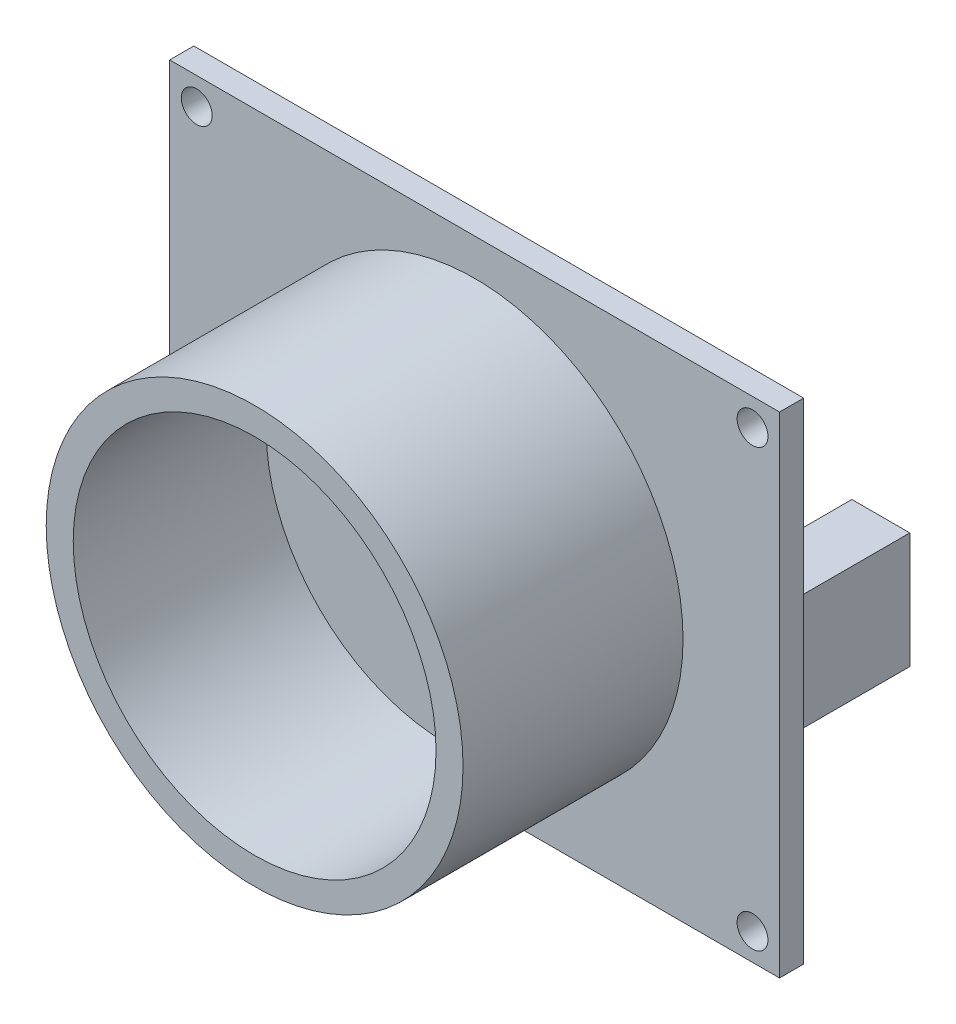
ISO-10303-21;
HEADER;
FILE_DESCRIPTION(('STEP AP214'),'2;1');
FILE_NAME('part.step','',(''),(''),'','','');
FILE_SCHEMA(('AUTOMOTIVE_DESIGN { 1 0 10303 214 1 1 1 1 }'));
ENDSEC;
DATA;
#1=APPLICATION_CONTEXT('core data for automotive mechanical design processes');
#2=APPLICATION_PROTOCOL_DEFINITION('international standard','automotive_design',2000,#1);
#3=PRODUCT_CONTEXT('',#1,'mechanical');
#4=PRODUCT('Part','Part','',(#3));
#5=PRODUCT_RELATED_PRODUCT_CATEGORY('part','',(#4));
#6=PRODUCT_DEFINITION_FORMATION('','',#4);
#7=PRODUCT_DEFINITION_CONTEXT('part definition',#1,'design');
#8=PRODUCT_DEFINITION('design','',#6,#7);
#9=PRODUCT_DEFINITION_SHAPE('','',#8);
#10=(LENGTH_UNIT() NAMED_UNIT(*) SI_UNIT(.MILLI.,.METRE.));
#11=(NAMED_UNIT(*) PLANE_ANGLE_UNIT() SI_UNIT($,.RADIAN.));
#12=(NAMED_UNIT(*) SI_UNIT($,.STERADIAN.) SOLID_ANGLE_UNIT());
#13=UNCERTAINTY_MEASURE_WITH_UNIT(LENGTH_MEASURE(1.E-05),#10,'distance_accuracy_value','');
#14=(GEOMETRIC_REPRESENTATION_CONTEXT(3) GLOBAL_UNCERTAINTY_ASSIGNED_CONTEXT((#13)) GLOBAL_UNIT_ASSIGNED_CONTEXT((#10,
#11,#12)) REPRESENTATION_CONTEXT('',''));
#15=CARTESIAN_POINT('',(0.,0.,0.));
#16=DIRECTION('',(0.,0.,1.));
#17=DIRECTION('',(1.,0.,0.));
#18=AXIS2_PLACEMENT_3D('',#15,#16,#17);
#19=CARTESIAN_POINT('',(0.,0.,0.));
#20=DIRECTION('',(0.,0.,-1.));
#21=DIRECTION('',(-1.,0.,0.));
#22=AXIS2_PLACEMENT_3D('',#19,#20,#21);
#23=PLANE('',#22);
#24=DIRECTION('',(0.,1.,0.));
#25=VECTOR('',#24,1.);
#26=CARTESIAN_POINT('',(20.066,-16.129,0.));
#27=LINE('',#26,#25);
#28=CARTESIAN_POINT('',(20.066,-16.129,0.));
#29=VERTEX_POINT('',#28);
#30=CARTESIAN_POINT('',(20.066,16.129,0.));
#31=VERTEX_POINT('',#30);
#32=EDGE_CURVE('E169',#29,#31,#27,.T.);
#33=ORIENTED_EDGE('',*,*,#32,.F.);
#34=DIRECTION('',(1.,0.,0.));
#35=VECTOR('',#34,1.);
#36=CARTESIAN_POINT('',(-20.066,-16.129,0.));
#37=LINE('',#36,#35);
#38=CARTESIAN_POINT('',(-20.066,-16.129,0.));
#39=VERTEX_POINT('',#38);
#40=EDGE_CURVE('E79',#39,#29,#37,.T.);
#41=ORIENTED_EDGE('',*,*,#40,.F.);
#42=DIRECTION('',(0.,-1.,0.));
#43=VECTOR('',#42,1.);
#44=CARTESIAN_POINT('',(-20.066,-16.129,0.));
#45=LINE('',#44,#43);
#46=CARTESIAN_POINT('',(-20.066,16.129,0.));
#47=VERTEX_POINT('',#46);
#48=EDGE_CURVE('E183',#47,#39,#45,.T.);
#49=ORIENTED_EDGE('',*,*,#48,.F.);
#50=DIRECTION('',(-1.,0.,0.));
#51=VECTOR('',#50,1.);
#52=CARTESIAN_POINT('',(-20.066,16.129,0.));
#53=LINE('',#52,#51);
#54=EDGE_CURVE('E181',#31,#47,#53,.T.);
#55=ORIENTED_EDGE('',*,*,#54,.F.);
#56=EDGE_LOOP('',(#33,#41,#49,#55));
#57=FACE_BOUND('',#56,.T.);
#58=CARTESIAN_POINT('',(18.288,14.351,0.));
#59=DIRECTION('',(0.,0.,1.));
#60=DIRECTION('',(1.,0.,0.));
#61=AXIS2_PLACEMENT_3D('',#58,#59,#60);
#62=CIRCLE('',#61,1.016);
#63=CARTESIAN_POINT('',(19.304,14.351,0.));
#64=VERTEX_POINT('',#63);
#65=EDGE_CURVE('E166',#64,#64,#62,.T.);
#66=ORIENTED_EDGE('',*,*,#65,.T.);
#67=EDGE_LOOP('',(#66));
#68=FACE_BOUND('',#67,.T.);
#69=CARTESIAN_POINT('',(18.288,-14.351,0.));
#70=DIRECTION('',(0.,0.,1.));
#71=DIRECTION('',(-1.,0.,0.));
#72=AXIS2_PLACEMENT_3D('',#69,#70,#71);
#73=CIRCLE('',#72,1.016);
#74=CARTESIAN_POINT('',(17.272,-14.351,0.));
#75=VERTEX_POINT('',#74);
#76=EDGE_CURVE('E160',#75,#75,#73,.T.);
#77=ORIENTED_EDGE('',*,*,#76,.T.);
#78=EDGE_LOOP('',(#77));
#79=FACE_BOUND('',#78,.T.);
#80=CARTESIAN_POINT('',(-18.288,-14.351,0.));
#81=DIRECTION('',(0.,0.,1.));
#82=DIRECTION('',(1.,0.,0.));
#83=AXIS2_PLACEMENT_3D('',#80,#81,#82);
#84=CIRCLE('',#83,1.016);
#85=CARTESIAN_POINT('',(-17.272,-14.351,0.));
#86=VERTEX_POINT('',#85);
#87=EDGE_CURVE('E154',#86,#86,#84,.T.);
#88=ORIENTED_EDGE('',*,*,#87,.T.);
#89=EDGE_LOOP('',(#88));
#90=FACE_BOUND('',#89,.T.);
#91=CARTESIAN_POINT('',(-18.288,14.351,0.));
#92=DIRECTION('',(0.,0.,1.));
#93=DIRECTION('',(-1.,0.,0.));
#94=AXIS2_PLACEMENT_3D('',#91,#92,#93);
#95=CIRCLE('',#94,1.016);
#96=CARTESIAN_POINT('',(-19.304,14.351,0.));
#97=VERTEX_POINT('',#96);
#98=EDGE_CURVE('E148',#97,#97,#95,.T.);
#99=ORIENTED_EDGE('',*,*,#98,.T.);
#100=EDGE_LOOP('',(#99));
#101=FACE_BOUND('',#100,.T.);
#102=DIRECTION('',(1.,0.,0.));
#103=VECTOR('',#102,1.);
#104=CARTESIAN_POINT('',(18.923,3.81,0.));
#105=LINE('',#104,#103);
#106=CARTESIAN_POINT('',(15.113,3.81,0.));
#107=VERTEX_POINT('',#106);
#108=CARTESIAN_POINT('',(18.923,3.81,0.));
#109=VERTEX_POINT('',#108);
#110=EDGE_CURVE('E347',#107,#109,#105,.T.);
#111=ORIENTED_EDGE('',*,*,#110,.F.);
#112=DIRECTION('',(0.,1.,0.));
#113=VECTOR('',#112,1.);
#114=CARTESIAN_POINT('',(15.113,-3.81,0.));
#115=LINE('',#114,#113);
#116=CARTESIAN_POINT('',(15.113,-3.81,0.));
#117=VERTEX_POINT('',#116);
#118=EDGE_CURVE('E132',#117,#107,#115,.T.);
#119=ORIENTED_EDGE('',*,*,#118,.F.);
#120=DIRECTION('',(-1.,0.,0.));
#121=VECTOR('',#120,1.);
#122=CARTESIAN_POINT('',(18.923,-3.81,0.));
#123=LINE('',#122,#121);
#124=CARTESIAN_POINT('',(18.923,-3.81,0.));
#125=VERTEX_POINT('',#124);
#126=EDGE_CURVE('E128',#125,#117,#123,.T.);
#127=ORIENTED_EDGE('',*,*,#126,.F.);
#128=DIRECTION('',(0.,-1.,0.));
#129=VECTOR('',#128,1.);
#130=CARTESIAN_POINT('',(18.923,-3.81,0.));
#131=LINE('',#130,#129);
#132=EDGE_CURVE('E344',#109,#125,#131,.T.);
#133=ORIENTED_EDGE('',*,*,#132,.F.);
#134=EDGE_LOOP('',(#111,#119,#127,#133));
#135=FACE_BOUND('',#134,.T.);
#136=ADVANCED_FACE('F34',(#57,#68,#79,#90,#101,#135),#23,.T.);
#137=CARTESIAN_POINT('',(0.,0.,1.5875));
#138=DIRECTION('',(0.,0.,-1.));
#139=DIRECTION('',(-1.,0.,0.));
#140=AXIS2_PLACEMENT_3D('',#137,#138,#139);
#141=PLANE('',#140);
#142=DIRECTION('',(0.,1.,0.));
#143=VECTOR('',#142,1.);
#144=CARTESIAN_POINT('',(20.066,-16.129,1.5875));
#145=LINE('',#144,#143);
#146=CARTESIAN_POINT('',(20.066,-16.129,1.5875));
#147=VERTEX_POINT('',#146);
#148=CARTESIAN_POINT('',(20.066,16.129,1.5875));
#149=VERTEX_POINT('',#148);
#150=EDGE_CURVE('E172',#147,#149,#145,.T.);
#151=ORIENTED_EDGE('',*,*,#150,.T.);
#152=DIRECTION('',(-1.,0.,0.));
#153=VECTOR('',#152,1.);
#154=CARTESIAN_POINT('',(-20.066,16.129,1.5875));
#155=LINE('',#154,#153);
#156=CARTESIAN_POINT('',(-20.066,16.129,1.5875));
#157=VERTEX_POINT('',#156);
#158=EDGE_CURVE('E87',#149,#157,#155,.T.);
#159=ORIENTED_EDGE('',*,*,#158,.T.);
#160=DIRECTION('',(0.,-1.,0.));
#161=VECTOR('',#160,1.);
#162=CARTESIAN_POINT('',(-20.066,-16.129,1.5875));
#163=LINE('',#162,#161);
#164=CARTESIAN_POINT('',(-20.066,-16.129,1.5875));
#165=VERTEX_POINT('',#164);
#166=EDGE_CURVE('E175',#157,#165,#163,.T.);
#167=ORIENTED_EDGE('',*,*,#166,.T.);
#168=DIRECTION('',(1.,0.,0.));
#169=VECTOR('',#168,1.);
#170=CARTESIAN_POINT('',(-20.066,-16.129,1.5875));
#171=LINE('',#170,#169);
#172=EDGE_CURVE('E58',#165,#147,#171,.T.);
#173=ORIENTED_EDGE('',*,*,#172,.T.);
#174=EDGE_LOOP('',(#151,#159,#167,#173));
#175=FACE_BOUND('',#174,.T.);
#176=CARTESIAN_POINT('',(18.288,14.351,1.5875));
#177=DIRECTION('',(0.,0.,1.));
#178=DIRECTION('',(1.,0.,0.));
#179=AXIS2_PLACEMENT_3D('',#176,#177,#178);
#180=CIRCLE('',#179,1.016);
#181=CARTESIAN_POINT('',(19.304,14.351,1.5875));
#182=VERTEX_POINT('',#181);
#183=EDGE_CURVE('E163',#182,#182,#180,.T.);
#184=ORIENTED_EDGE('',*,*,#183,.F.);
#185=EDGE_LOOP('',(#184));
#186=FACE_BOUND('',#185,.T.);
#187=CARTESIAN_POINT('',(18.288,-14.351,1.5875));
#188=DIRECTION('',(0.,0.,1.));
#189=DIRECTION('',(-1.,0.,0.));
#190=AXIS2_PLACEMENT_3D('',#187,#188,#189);
#191=CIRCLE('',#190,1.016);
#192=CARTESIAN_POINT('',(17.272,-14.351,1.5875));
#193=VERTEX_POINT('',#192);
#194=EDGE_CURVE('E157',#193,#193,#191,.T.);
#195=ORIENTED_EDGE('',*,*,#194,.F.);
#196=EDGE_LOOP('',(#195));
#197=FACE_BOUND('',#196,.T.);
#198=CARTESIAN_POINT('',(-18.288,-14.351,1.5875));
#199=DIRECTION('',(0.,0.,1.));
#200=DIRECTION('',(1.,0.,0.));
#201=AXIS2_PLACEMENT_3D('',#198,#199,#200);
#202=CIRCLE('',#201,1.016);
#203=CARTESIAN_POINT('',(-17.272,-14.351,1.5875));
#204=VERTEX_POINT('',#203);
#205=EDGE_CURVE('E151',#204,#204,#202,.T.);
#206=ORIENTED_EDGE('',*,*,#205,.F.);
#207=EDGE_LOOP('',(#206));
#208=FACE_BOUND('',#207,.T.);
#209=CARTESIAN_POINT('',(-18.288,14.351,1.5875));
#210=DIRECTION('',(0.,0.,1.));
#211=DIRECTION('',(-1.,0.,0.));
#212=AXIS2_PLACEMENT_3D('',#209,#210,#211);
#213=CIRCLE('',#212,1.016);
#214=CARTESIAN_POINT('',(-19.304,14.351,1.5875));
#215=VERTEX_POINT('',#214);
#216=EDGE_CURVE('E147',#215,#215,#213,.T.);
#217=ORIENTED_EDGE('',*,*,#216,.F.);
#218=EDGE_LOOP('',(#217));
#219=FACE_BOUND('',#218,.T.);
#220=CARTESIAN_POINT('',(0.,0.,1.5875));
#221=DIRECTION('',(0.,0.,-1.));
#222=DIRECTION('',(-1.,0.,0.));
#223=AXIS2_PLACEMENT_3D('',#220,#221,#222);
#224=CIRCLE('',#223,13.716);
#225=CARTESIAN_POINT('',(-13.716,0.,1.5875));
#226=VERTEX_POINT('',#225);
#227=EDGE_CURVE('E11',#226,#226,#224,.F.);
#228=ORIENTED_EDGE('',*,*,#227,.F.);
#229=EDGE_LOOP('',(#228));
#230=FACE_BOUND('',#229,.T.);
#231=ADVANCED_FACE('F204',(#175,#186,#197,#208,#219,#230),#141,.F.);
#232=CARTESIAN_POINT('',(20.066,-16.129,1.5875));
#233=DIRECTION('',(-1.,0.,0.));
#234=DIRECTION('',(0.,0.,1.));
#235=AXIS2_PLACEMENT_3D('',#232,#233,#234);
#236=PLANE('',#235);
#237=ORIENTED_EDGE('',*,*,#32,.T.);
#238=DIRECTION('',(0.,0.,-1.));
#239=VECTOR('',#238,1.);
#240=CARTESIAN_POINT('',(20.066,16.129,1.5875));
#241=LINE('',#240,#239);
#242=EDGE_CURVE('E42',#149,#31,#241,.T.);
#243=ORIENTED_EDGE('',*,*,#242,.F.);
#244=ORIENTED_EDGE('',*,*,#150,.F.);
#245=DIRECTION('',(0.,0.,-1.));
#246=VECTOR('',#245,1.);
#247=CARTESIAN_POINT('',(20.066,-16.129,1.5875));
#248=LINE('',#247,#246);
#249=EDGE_CURVE('E178',#147,#29,#248,.T.);
#250=ORIENTED_EDGE('',*,*,#249,.T.);
#251=EDGE_LOOP('',(#237,#243,#244,#250));
#252=FACE_BOUND('',#251,.T.);
#253=ADVANCED_FACE('F36',(#252),#236,.F.);
#254=CARTESIAN_POINT('',(-20.066,16.129,1.5875));
#255=DIRECTION('',(0.,-1.,0.));
#256=DIRECTION('',(0.,0.,-1.));
#257=AXIS2_PLACEMENT_3D('',#254,#255,#256);
#258=PLANE('',#257);
#259=ORIENTED_EDGE('',*,*,#54,.T.);
#260=DIRECTION('',(0.,0.,-1.));
#261=VECTOR('',#260,1.);
#262=CARTESIAN_POINT('',(-20.066,16.129,1.5875));
#263=LINE('',#262,#261);
#264=EDGE_CURVE('E189',#157,#47,#263,.T.);
#265=ORIENTED_EDGE('',*,*,#264,.F.);
#266=ORIENTED_EDGE('',*,*,#158,.F.);
#267=ORIENTED_EDGE('',*,*,#242,.T.);
#268=EDGE_LOOP('',(#259,#265,#266,#267));
#269=FACE_BOUND('',#268,.T.);
#270=ADVANCED_FACE('F192',(#269),#258,.F.);
#271=CARTESIAN_POINT('',(-20.066,-16.129,1.5875));
#272=DIRECTION('',(1.,0.,0.));
#273=DIRECTION('',(0.,0.,-1.));
#274=AXIS2_PLACEMENT_3D('',#271,#272,#273);
#275=PLANE('',#274);
#276=ORIENTED_EDGE('',*,*,#48,.T.);
#277=DIRECTION('',(0.,0.,-1.));
#278=VECTOR('',#277,1.);
#279=CARTESIAN_POINT('',(-20.066,-16.129,1.5875));
#280=LINE('',#279,#278);
#281=EDGE_CURVE('E187',#165,#39,#280,.T.);
#282=ORIENTED_EDGE('',*,*,#281,.F.);
#283=ORIENTED_EDGE('',*,*,#166,.F.);
#284=ORIENTED_EDGE('',*,*,#264,.T.);
#285=EDGE_LOOP('',(#276,#282,#283,#284));
#286=FACE_BOUND('',#285,.T.);
#287=ADVANCED_FACE('F201',(#286),#275,.F.);
#288=CARTESIAN_POINT('',(-20.066,-16.129,1.5875));
#289=DIRECTION('',(0.,1.,0.));
#290=DIRECTION('',(0.,0.,1.));
#291=AXIS2_PLACEMENT_3D('',#288,#289,#290);
#292=PLANE('',#291);
#293=ORIENTED_EDGE('',*,*,#40,.T.);
#294=ORIENTED_EDGE('',*,*,#249,.F.);
#295=ORIENTED_EDGE('',*,*,#172,.F.);
#296=ORIENTED_EDGE('',*,*,#281,.T.);
#297=EDGE_LOOP('',(#293,#294,#295,#296));
#298=FACE_BOUND('',#297,.T.);
#299=ADVANCED_FACE('F203',(#298),#292,.F.);
#300=CARTESIAN_POINT('',(18.288,14.351,0.));
#301=DIRECTION('',(0.,0.,1.));
#302=DIRECTION('',(1.,0.,0.));
#303=AXIS2_PLACEMENT_3D('',#300,#301,#302);
#304=CYLINDRICAL_SURFACE('',#303,1.016);
#305=ORIENTED_EDGE('',*,*,#65,.F.);
#306=EDGE_LOOP('',(#305));
#307=FACE_BOUND('',#306,.T.);
#308=ORIENTED_EDGE('',*,*,#183,.T.);
#309=EDGE_LOOP('',(#308));
#310=FACE_BOUND('',#309,.T.);
#311=ADVANCED_FACE('F243',(#307,#310),#304,.F.);
#312=CARTESIAN_POINT('',(18.288,-14.351,0.));
#313=DIRECTION('',(0.,0.,1.));
#314=DIRECTION('',(1.,0.,0.));
#315=AXIS2_PLACEMENT_3D('',#312,#313,#314);
#316=CYLINDRICAL_SURFACE('',#315,1.016);
#317=ORIENTED_EDGE('',*,*,#76,.F.);
#318=EDGE_LOOP('',(#317));
#319=FACE_BOUND('',#318,.T.);
#320=ORIENTED_EDGE('',*,*,#194,.T.);
#321=EDGE_LOOP('',(#320));
#322=FACE_BOUND('',#321,.T.);
#323=ADVANCED_FACE('F365',(#319,#322),#316,.F.);
#324=CARTESIAN_POINT('',(-18.288,-14.351,0.));
#325=DIRECTION('',(0.,0.,1.));
#326=DIRECTION('',(1.,0.,0.));
#327=AXIS2_PLACEMENT_3D('',#324,#325,#326);
#328=CYLINDRICAL_SURFACE('',#327,1.016);
#329=ORIENTED_EDGE('',*,*,#87,.F.);
#330=EDGE_LOOP('',(#329));
#331=FACE_BOUND('',#330,.T.);
#332=ORIENTED_EDGE('',*,*,#205,.T.);
#333=EDGE_LOOP('',(#332));
#334=FACE_BOUND('',#333,.T.);
#335=ADVANCED_FACE('F231',(#331,#334),#328,.F.);
#336=CARTESIAN_POINT('',(-18.288,14.351,0.));
#337=DIRECTION('',(0.,0.,1.));
#338=DIRECTION('',(1.,0.,0.));
#339=AXIS2_PLACEMENT_3D('',#336,#337,#338);
#340=CYLINDRICAL_SURFACE('',#339,1.016);
#341=ORIENTED_EDGE('',*,*,#98,.F.);
#342=EDGE_LOOP('',(#341));
#343=FACE_BOUND('',#342,.T.);
#344=ORIENTED_EDGE('',*,*,#216,.T.);
#345=EDGE_LOOP('',(#344));
#346=FACE_BOUND('',#345,.T.);
#347=ADVANCED_FACE('F221',(#343,#346),#340,.F.);
#348=CARTESIAN_POINT('',(0.,0.,16.0655));
#349=DIRECTION('',(0.,0.,-1.));
#350=DIRECTION('',(-1.,0.,0.));
#351=AXIS2_PLACEMENT_3D('',#348,#349,#350);
#352=CYLINDRICAL_SURFACE('',#351,13.716);
#353=CARTESIAN_POINT('',(0.,0.,16.0655));
#354=DIRECTION('',(0.,0.,1.));
#355=DIRECTION('',(1.,0.,0.));
#356=AXIS2_PLACEMENT_3D('',#353,#354,#355);
#357=CIRCLE('',#356,13.716);
#358=CARTESIAN_POINT('',(13.716,0.,16.0655));
#359=VERTEX_POINT('',#358);
#360=EDGE_CURVE('E143',#359,#359,#357,.T.);
#361=ORIENTED_EDGE('',*,*,#360,.F.);
#362=EDGE_LOOP('',(#361));
#363=FACE_BOUND('',#362,.T.);
#364=ORIENTED_EDGE('',*,*,#227,.T.);
#365=EDGE_LOOP('',(#364));
#366=FACE_BOUND('',#365,.T.);
#367=ADVANCED_FACE('F218',(#363,#366),#352,.T.);
#368=CARTESIAN_POINT('',(0.,0.,16.0655));
#369=DIRECTION('',(0.,0.,1.));
#370=DIRECTION('',(1.,0.,0.));
#371=AXIS2_PLACEMENT_3D('',#368,#369,#370);
#372=PLANE('',#371);
#373=CARTESIAN_POINT('',(0.,0.,16.0655));
#374=DIRECTION('',(0.,0.,1.));
#375=DIRECTION('',(1.,0.,0.));
#376=AXIS2_PLACEMENT_3D('',#373,#374,#375);
#377=CIRCLE('',#376,11.938);
#378=CARTESIAN_POINT('',(11.938,0.,16.0655));
#379=VERTEX_POINT('',#378);
#380=EDGE_CURVE('E134',#379,#379,#377,.T.);
#381=ORIENTED_EDGE('',*,*,#380,.F.);
#382=EDGE_LOOP('',(#381));
#383=FACE_BOUND('',#382,.T.);
#384=ORIENTED_EDGE('',*,*,#360,.T.);
#385=EDGE_LOOP('',(#384));
#386=FACE_BOUND('',#385,.T.);
#387=ADVANCED_FACE('F220',(#383,#386),#372,.T.);
#388=CARTESIAN_POINT('',(0.,0.,3.3655));
#389=DIRECTION('',(0.,0.,1.));
#390=DIRECTION('',(1.,0.,0.));
#391=AXIS2_PLACEMENT_3D('',#388,#389,#390);
#392=CYLINDRICAL_SURFACE('',#391,11.938);
#393=CARTESIAN_POINT('',(0.,0.,3.3655));
#394=DIRECTION('',(0.,0.,1.));
#395=DIRECTION('',(1.,0.,0.));
#396=AXIS2_PLACEMENT_3D('',#393,#394,#395);
#397=CIRCLE('',#396,11.938);
#398=CARTESIAN_POINT('',(11.938,0.,3.3655));
#399=VERTEX_POINT('',#398);
#400=EDGE_CURVE('E137',#399,#399,#397,.T.);
#401=ORIENTED_EDGE('',*,*,#400,.F.);
#402=EDGE_LOOP('',(#401));
#403=FACE_BOUND('',#402,.T.);
#404=ORIENTED_EDGE('',*,*,#380,.T.);
#405=EDGE_LOOP('',(#404));
#406=FACE_BOUND('',#405,.T.);
#407=ADVANCED_FACE('F228',(#403,#406),#392,.F.);
#408=CARTESIAN_POINT('',(0.,0.,3.3655));
#409=DIRECTION('',(0.,0.,1.));
#410=DIRECTION('',(1.,0.,0.));
#411=AXIS2_PLACEMENT_3D('',#408,#409,#410);
#412=PLANE('',#411);
#413=ORIENTED_EDGE('',*,*,#400,.T.);
#414=EDGE_LOOP('',(#413));
#415=FACE_BOUND('',#414,.T.);
#416=ADVANCED_FACE('F279',(#415),#412,.T.);
#417=CARTESIAN_POINT('',(15.113,-3.81,-8.128));
#418=DIRECTION('',(1.,0.,0.));
#419=DIRECTION('',(0.,0.,-1.));
#420=AXIS2_PLACEMENT_3D('',#417,#418,#419);
#421=PLANE('',#420);
#422=ORIENTED_EDGE('',*,*,#118,.T.);
#423=DIRECTION('',(0.,0.,1.));
#424=VECTOR('',#423,1.);
#425=CARTESIAN_POINT('',(15.113,3.81,-8.128));
#426=LINE('',#425,#424);
#427=CARTESIAN_POINT('',(15.113,3.81,-8.128));
#428=VERTEX_POINT('',#427);
#429=EDGE_CURVE('E113',#428,#107,#426,.T.);
#430=ORIENTED_EDGE('',*,*,#429,.F.);
#431=DIRECTION('',(0.,1.,0.));
#432=VECTOR('',#431,1.);
#433=CARTESIAN_POINT('',(15.113,-3.81,-8.128));
#434=LINE('',#433,#432);
#435=CARTESIAN_POINT('',(15.113,-3.81,-8.128));
#436=VERTEX_POINT('',#435);
#437=EDGE_CURVE('E120',#436,#428,#434,.T.);
#438=ORIENTED_EDGE('',*,*,#437,.F.);
#439=DIRECTION('',(0.,0.,1.));
#440=VECTOR('',#439,1.);
#441=CARTESIAN_POINT('',(15.113,-3.81,-8.128));
#442=LINE('',#441,#440);
#443=EDGE_CURVE('E341',#436,#117,#442,.T.);
#444=ORIENTED_EDGE('',*,*,#443,.T.);
#445=EDGE_LOOP('',(#422,#430,#438,#444));
#446=FACE_BOUND('',#445,.T.);
#447=ADVANCED_FACE('F130',(#446),#421,.F.);
#448=CARTESIAN_POINT('',(18.923,3.81,-8.128));
#449=DIRECTION('',(0.,-1.,0.));
#450=DIRECTION('',(0.,0.,-1.));
#451=AXIS2_PLACEMENT_3D('',#448,#449,#450);
#452=PLANE('',#451);
#453=ORIENTED_EDGE('',*,*,#110,.T.);
#454=DIRECTION('',(0.,0.,1.));
#455=VECTOR('',#454,1.);
#456=CARTESIAN_POINT('',(18.923,3.81,-8.128));
#457=LINE('',#456,#455);
#458=CARTESIAN_POINT('',(18.923,3.81,-8.128));
#459=VERTEX_POINT('',#458);
#460=EDGE_CURVE('E116',#459,#109,#457,.T.);
#461=ORIENTED_EDGE('',*,*,#460,.F.);
#462=DIRECTION('',(1.,0.,0.));
#463=VECTOR('',#462,1.);
#464=CARTESIAN_POINT('',(18.923,3.81,-8.128));
#465=LINE('',#464,#463);
#466=EDGE_CURVE('E109',#428,#459,#465,.T.);
#467=ORIENTED_EDGE('',*,*,#466,.F.);
#468=ORIENTED_EDGE('',*,*,#429,.T.);
#469=EDGE_LOOP('',(#453,#461,#467,#468));
#470=FACE_BOUND('',#469,.T.);
#471=ADVANCED_FACE('F111',(#470),#452,.F.);
#472=CARTESIAN_POINT('',(18.923,-3.81,-8.128));
#473=DIRECTION('',(-1.,0.,0.));
#474=DIRECTION('',(0.,0.,1.));
#475=AXIS2_PLACEMENT_3D('',#472,#473,#474);
#476=PLANE('',#475);
#477=ORIENTED_EDGE('',*,*,#132,.T.);
#478=DIRECTION('',(0.,0.,1.));
#479=VECTOR('',#478,1.);
#480=CARTESIAN_POINT('',(18.923,-3.81,-8.128));
#481=LINE('',#480,#479);
#482=CARTESIAN_POINT('',(18.923,-3.81,-8.128));
#483=VERTEX_POINT('',#482);
#484=EDGE_CURVE('E49',#483,#125,#481,.T.);
#485=ORIENTED_EDGE('',*,*,#484,.F.);
#486=DIRECTION('',(0.,-1.,0.));
#487=VECTOR('',#486,1.);
#488=CARTESIAN_POINT('',(18.923,-3.81,-8.128));
#489=LINE('',#488,#487);
#490=EDGE_CURVE('E119',#459,#483,#489,.T.);
#491=ORIENTED_EDGE('',*,*,#490,.F.);
#492=ORIENTED_EDGE('',*,*,#460,.T.);
#493=EDGE_LOOP('',(#477,#485,#491,#492));
#494=FACE_BOUND('',#493,.T.);
#495=ADVANCED_FACE('F310',(#494),#476,.F.);
#496=CARTESIAN_POINT('',(18.923,-3.81,-8.128));
#497=DIRECTION('',(0.,1.,0.));
#498=DIRECTION('',(0.,0.,1.));
#499=AXIS2_PLACEMENT_3D('',#496,#497,#498);
#500=PLANE('',#499);
#501=ORIENTED_EDGE('',*,*,#126,.T.);
#502=ORIENTED_EDGE('',*,*,#443,.F.);
#503=DIRECTION('',(-1.,0.,0.));
#504=VECTOR('',#503,1.);
#505=CARTESIAN_POINT('',(18.923,-3.81,-8.128));
#506=LINE('',#505,#504);
#507=EDGE_CURVE('E124',#483,#436,#506,.T.);
#508=ORIENTED_EDGE('',*,*,#507,.F.);
#509=ORIENTED_EDGE('',*,*,#484,.T.);
#510=EDGE_LOOP('',(#501,#502,#508,#509));
#511=FACE_BOUND('',#510,.T.);
#512=ADVANCED_FACE('F319',(#511),#500,.F.);
#513=CARTESIAN_POINT('',(0.,0.,-8.128));
#514=DIRECTION('',(0.,0.,1.));
#515=DIRECTION('',(1.,0.,0.));
#516=AXIS2_PLACEMENT_3D('',#513,#514,#515);
#517=PLANE('',#516);
#518=ORIENTED_EDGE('',*,*,#437,.T.);
#519=ORIENTED_EDGE('',*,*,#466,.T.);
#520=ORIENTED_EDGE('',*,*,#490,.T.);
#521=ORIENTED_EDGE('',*,*,#507,.T.);
#522=EDGE_LOOP('',(#518,#519,#520,#521));
#523=FACE_BOUND('',#522,.T.);
#524=ADVANCED_FACE('F123',(#523),#517,.F.);
#525=CLOSED_SHELL('',(#136,#231,#253,#270,#287,#299,#311,#323,#335,#347,#367,#387,#407,#416,
#447,#471,#495,#512,#524));
#526=MANIFOLD_SOLID_BREP('B2',#525);
#527=ADVANCED_BREP_SHAPE_REPRESENTATION('',(#18,#526),#14);
#528=SHAPE_DEFINITION_REPRESENTATION(#9,#527);
ENDSEC;
END-ISO-10303-21;
